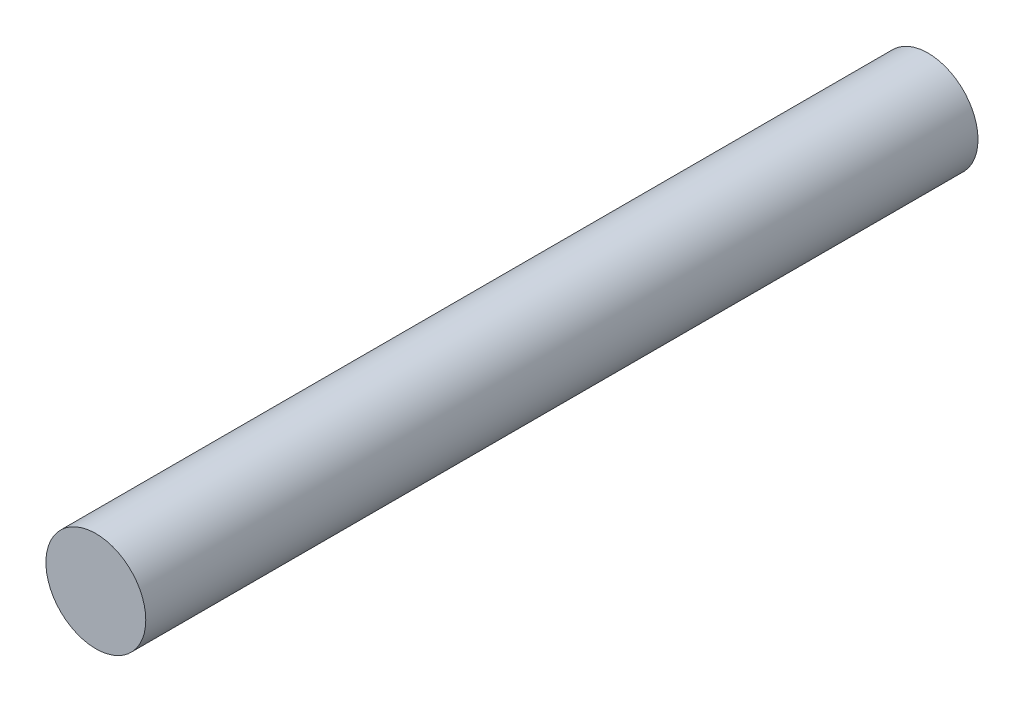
from build123d import *

# Parameters (mm, degrees)
SKETCH1_R           = 30
BOSS_EXTRUDE1_DEPTH = 500


with BuildPart() as part:
    # Sketch1 → Boss-Extrude1 (new body)
    with BuildSketch(Plane.XY):
        Circle(SKETCH1_R)
    extrude(amount=-BOSS_EXTRUDE1_DEPTH)


solid = part.part
